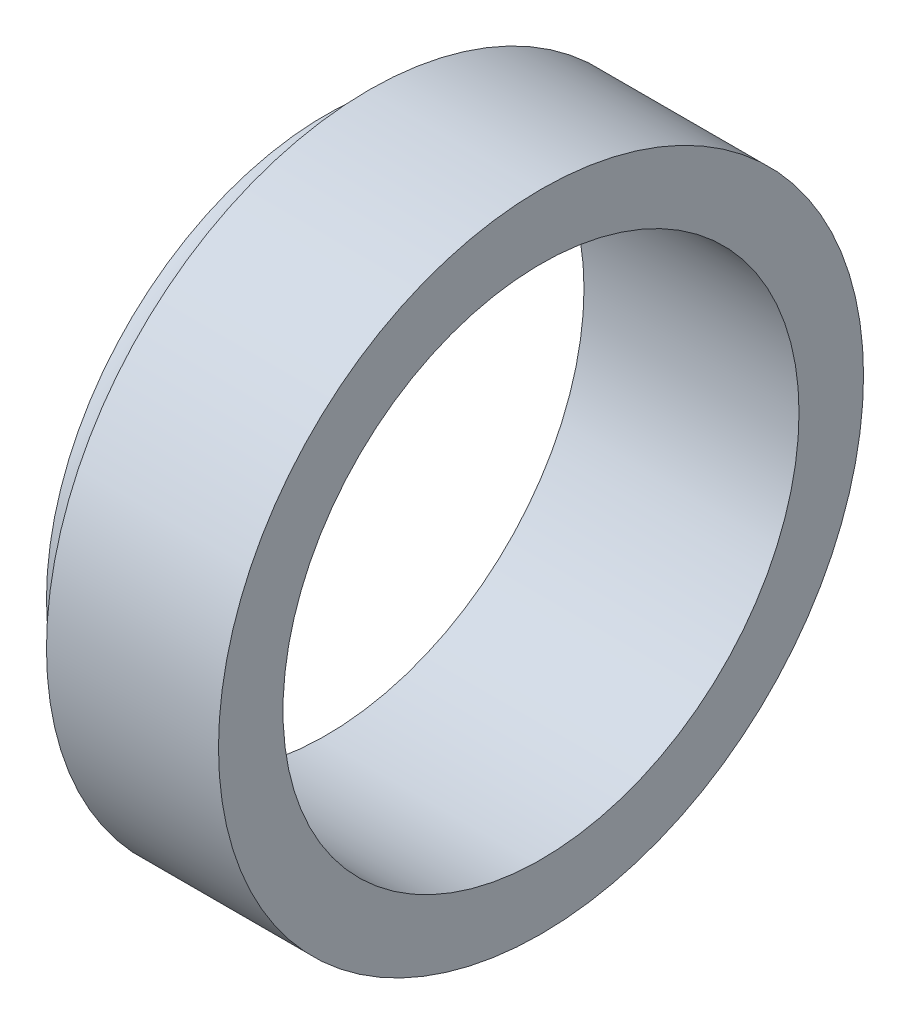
ISO-10303-21;
HEADER;
FILE_DESCRIPTION(('STEP AP214'),'2;1');
FILE_NAME('part.step','',(''),(''),'','','');
FILE_SCHEMA(('AUTOMOTIVE_DESIGN { 1 0 10303 214 1 1 1 1 }'));
ENDSEC;
DATA;
#1=APPLICATION_CONTEXT('core data for automotive mechanical design processes');
#2=APPLICATION_PROTOCOL_DEFINITION('international standard','automotive_design',2000,#1);
#3=PRODUCT_CONTEXT('',#1,'mechanical');
#4=PRODUCT('Part','Part','',(#3));
#5=PRODUCT_RELATED_PRODUCT_CATEGORY('part','',(#4));
#6=PRODUCT_DEFINITION_FORMATION('','',#4);
#7=PRODUCT_DEFINITION_CONTEXT('part definition',#1,'design');
#8=PRODUCT_DEFINITION('design','',#6,#7);
#9=PRODUCT_DEFINITION_SHAPE('','',#8);
#10=(LENGTH_UNIT() NAMED_UNIT(*) SI_UNIT(.MILLI.,.METRE.));
#11=(NAMED_UNIT(*) PLANE_ANGLE_UNIT() SI_UNIT($,.RADIAN.));
#12=(NAMED_UNIT(*) SI_UNIT($,.STERADIAN.) SOLID_ANGLE_UNIT());
#13=UNCERTAINTY_MEASURE_WITH_UNIT(LENGTH_MEASURE(1.E-05),#10,'distance_accuracy_value','');
#14=(GEOMETRIC_REPRESENTATION_CONTEXT(3) GLOBAL_UNCERTAINTY_ASSIGNED_CONTEXT((#13)) GLOBAL_UNIT_ASSIGNED_CONTEXT((#10,
#11,#12)) REPRESENTATION_CONTEXT('',''));
#15=CARTESIAN_POINT('',(0.,0.,0.));
#16=DIRECTION('',(0.,0.,1.));
#17=DIRECTION('',(1.,0.,0.));
#18=AXIS2_PLACEMENT_3D('',#15,#16,#17);
#19=CARTESIAN_POINT('',(0.,0.,0.));
#20=DIRECTION('',(1.,0.,0.));
#21=DIRECTION('',(0.,0.,-1.));
#22=AXIS2_PLACEMENT_3D('',#19,#20,#21);
#23=CYLINDRICAL_SURFACE('',#22,6.);
#24=CARTESIAN_POINT('',(5.,0.,0.));
#25=DIRECTION('',(1.,0.,0.));
#26=DIRECTION('',(0.,0.,-1.));
#27=AXIS2_PLACEMENT_3D('',#24,#25,#26);
#28=CIRCLE('',#27,6.);
#29=CARTESIAN_POINT('',(5.,0.,-6.));
#30=VERTEX_POINT('',#29);
#31=EDGE_CURVE('E10',#30,#30,#28,.T.);
#32=ORIENTED_EDGE('',*,*,#31,.T.);
#33=EDGE_LOOP('',(#32));
#34=FACE_BOUND('',#33,.T.);
#35=CARTESIAN_POINT('',(0.,0.,0.));
#36=DIRECTION('',(1.,0.,0.));
#37=DIRECTION('',(0.,0.,-1.));
#38=AXIS2_PLACEMENT_3D('',#35,#36,#37);
#39=CIRCLE('',#38,6.);
#40=CARTESIAN_POINT('',(0.,0.,-6.));
#41=VERTEX_POINT('',#40);
#42=EDGE_CURVE('E48',#41,#41,#39,.T.);
#43=ORIENTED_EDGE('',*,*,#42,.F.);
#44=EDGE_LOOP('',(#43));
#45=FACE_BOUND('',#44,.T.);
#46=ADVANCED_FACE('F29',(#34,#45),#23,.F.);
#47=CARTESIAN_POINT('',(5.,7.5,0.));
#48=DIRECTION('',(1.,0.,0.));
#49=DIRECTION('',(0.,0.,-1.));
#50=AXIS2_PLACEMENT_3D('',#47,#48,#49);
#51=PLANE('',#50);
#52=CARTESIAN_POINT('',(5.,0.,0.));
#53=DIRECTION('',(1.,0.,0.));
#54=DIRECTION('',(0.,0.,-1.));
#55=AXIS2_PLACEMENT_3D('',#52,#53,#54);
#56=CIRCLE('',#55,7.5);
#57=CARTESIAN_POINT('',(5.,0.,-7.5));
#58=VERTEX_POINT('',#57);
#59=EDGE_CURVE('E35',#58,#58,#56,.T.);
#60=ORIENTED_EDGE('',*,*,#59,.T.);
#61=EDGE_LOOP('',(#60));
#62=FACE_BOUND('',#61,.T.);
#63=ORIENTED_EDGE('',*,*,#31,.F.);
#64=EDGE_LOOP('',(#63));
#65=FACE_BOUND('',#64,.T.);
#66=ADVANCED_FACE('F56',(#62,#65),#51,.T.);
#67=CARTESIAN_POINT('',(0.,0.,0.));
#68=DIRECTION('',(1.,0.,0.));
#69=DIRECTION('',(0.,0.,-1.));
#70=AXIS2_PLACEMENT_3D('',#67,#68,#69);
#71=CYLINDRICAL_SURFACE('',#70,7.5);
#72=CARTESIAN_POINT('',(1.,0.,0.));
#73=DIRECTION('',(1.,0.,0.));
#74=DIRECTION('',(0.,0.,-1.));
#75=AXIS2_PLACEMENT_3D('',#72,#73,#74);
#76=CIRCLE('',#75,7.5);
#77=CARTESIAN_POINT('',(1.,0.,-7.5));
#78=VERTEX_POINT('',#77);
#79=EDGE_CURVE('E39',#78,#78,#76,.T.);
#80=ORIENTED_EDGE('',*,*,#79,.T.);
#81=EDGE_LOOP('',(#80));
#82=FACE_BOUND('',#81,.T.);
#83=ORIENTED_EDGE('',*,*,#59,.F.);
#84=EDGE_LOOP('',(#83));
#85=FACE_BOUND('',#84,.T.);
#86=ADVANCED_FACE('F60',(#82,#85),#71,.T.);
#87=CARTESIAN_POINT('',(0.,0.,0.));
#88=DIRECTION('',(1.,0.,0.));
#89=DIRECTION('',(0.,0.,-1.));
#90=AXIS2_PLACEMENT_3D('',#87,#88,#89);
#91=TOROIDAL_SURFACE('',#90,7.5,1.);
#92=CARTESIAN_POINT('',(0.,0.,0.));
#93=DIRECTION('',(1.,0.,0.));
#94=DIRECTION('',(0.,0.,-1.));
#95=AXIS2_PLACEMENT_3D('',#92,#93,#94);
#96=CIRCLE('',#95,6.5);
#97=CARTESIAN_POINT('',(0.,0.,-6.5));
#98=VERTEX_POINT('',#97);
#99=EDGE_CURVE('E43',#98,#98,#96,.T.);
#100=ORIENTED_EDGE('',*,*,#99,.T.);
#101=EDGE_LOOP('',(#100));
#102=FACE_BOUND('',#101,.T.);
#103=ORIENTED_EDGE('',*,*,#79,.F.);
#104=EDGE_LOOP('',(#103));
#105=FACE_BOUND('',#104,.T.);
#106=ADVANCED_FACE('F64',(#102,#105),#91,.F.);
#107=CARTESIAN_POINT('',(0.,6.,0.));
#108=DIRECTION('',(-1.,0.,0.));
#109=DIRECTION('',(0.,0.,1.));
#110=AXIS2_PLACEMENT_3D('',#107,#108,#109);
#111=PLANE('',#110);
#112=ORIENTED_EDGE('',*,*,#42,.T.);
#113=EDGE_LOOP('',(#112));
#114=FACE_BOUND('',#113,.T.);
#115=ORIENTED_EDGE('',*,*,#99,.F.);
#116=EDGE_LOOP('',(#115));
#117=FACE_BOUND('',#116,.T.);
#118=ADVANCED_FACE('F52',(#114,#117),#111,.T.);
#119=CLOSED_SHELL('',(#46,#66,#86,#106,#118));
#120=MANIFOLD_SOLID_BREP('B2',#119);
#121=ADVANCED_BREP_SHAPE_REPRESENTATION('',(#18,#120),#14);
#122=SHAPE_DEFINITION_REPRESENTATION(#9,#121);
ENDSEC;
END-ISO-10303-21;
